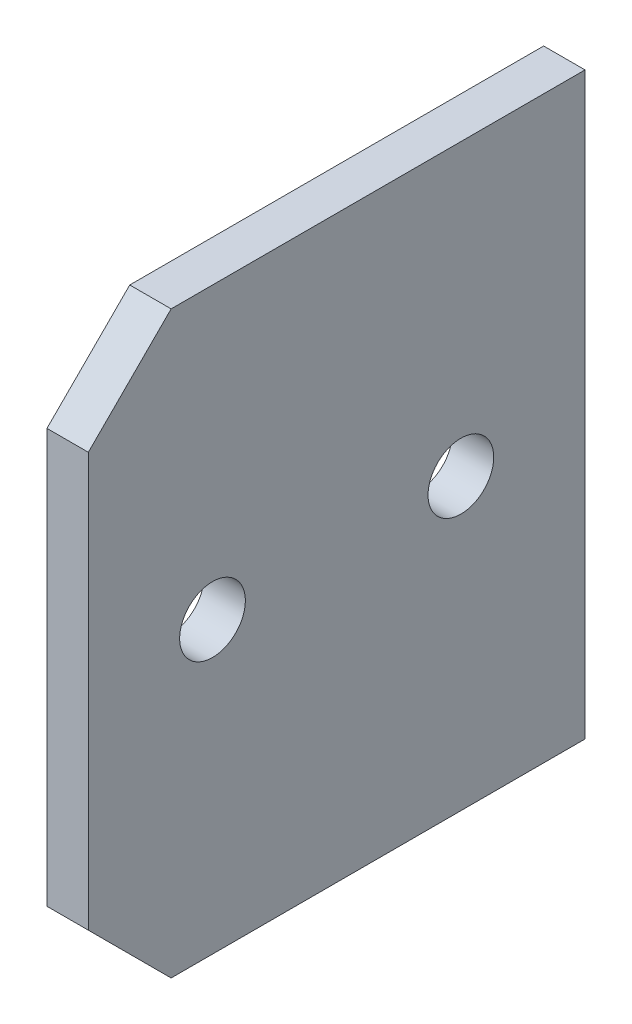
from build123d import *

# Parameters (mm, degrees)
SKETCH1_W          = 6.35
SKETCH1_H          = 88.9
BASE_EXTRUDE_DEPTH = 76.2
SKETCH2_R          = 5.0419
CUT_EXTRUDE1_DEPTH = 89.44526556
CHAMFER1_SIZE      = 12.7


with BuildPart() as part:
    # Sketch1 → Base-Extrude (new body)
    with BuildSketch(Plane.XY):
        Rectangle(SKETCH1_W, SKETCH1_H)
    extrude(amount=BASE_EXTRUDE_DEPTH)

    # Sketch2 → Cut-Extrude1 (cut, through all)
    with BuildSketch(Plane(origin=(3.175, 0, 0), x_dir=(0, 0, -1), z_dir=(1, 0, 0))):
        with Locations((-19.05, 0)):
            Circle(SKETCH2_R)
        with Locations((-57.15, 0)):
            Circle(SKETCH2_R)
    extrude(amount=-CUT_EXTRUDE1_DEPTH, mode=Mode.SUBTRACT)

    # Chamfer1
    chamfer1_edges = [part.edges().sort_by_distance(p)[0] for p in [
        (0, 44.45, 76.2),
        (0, -44.45, 76.2),
    ]]
    chamfer(chamfer1_edges, length=CHAMFER1_SIZE)


solid = part.part
